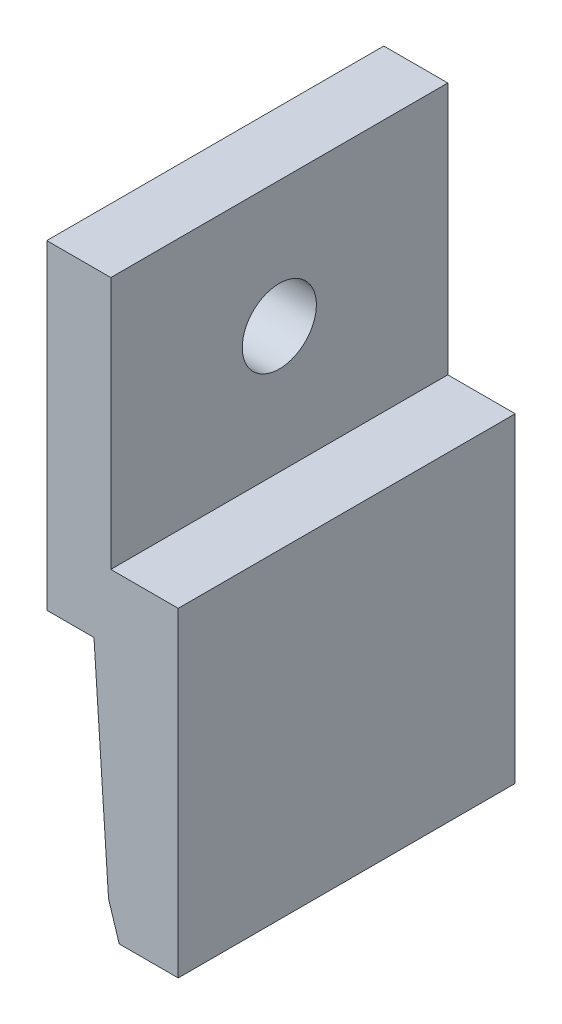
ISO-10303-21;
HEADER;
FILE_DESCRIPTION(('STEP AP214'),'2;1');
FILE_NAME('part.step','',(''),(''),'','','');
FILE_SCHEMA(('AUTOMOTIVE_DESIGN { 1 0 10303 214 1 1 1 1 }'));
ENDSEC;
DATA;
#1=APPLICATION_CONTEXT('core data for automotive mechanical design processes');
#2=APPLICATION_PROTOCOL_DEFINITION('international standard','automotive_design',2000,#1);
#3=PRODUCT_CONTEXT('',#1,'mechanical');
#4=PRODUCT('Part','Part','',(#3));
#5=PRODUCT_RELATED_PRODUCT_CATEGORY('part','',(#4));
#6=PRODUCT_DEFINITION_FORMATION('','',#4);
#7=PRODUCT_DEFINITION_CONTEXT('part definition',#1,'design');
#8=PRODUCT_DEFINITION('design','',#6,#7);
#9=PRODUCT_DEFINITION_SHAPE('','',#8);
#10=(LENGTH_UNIT() NAMED_UNIT(*) SI_UNIT(.MILLI.,.METRE.));
#11=(NAMED_UNIT(*) PLANE_ANGLE_UNIT() SI_UNIT($,.RADIAN.));
#12=(NAMED_UNIT(*) SI_UNIT($,.STERADIAN.) SOLID_ANGLE_UNIT());
#13=UNCERTAINTY_MEASURE_WITH_UNIT(LENGTH_MEASURE(1.E-05),#10,'distance_accuracy_value','');
#14=(GEOMETRIC_REPRESENTATION_CONTEXT(3) GLOBAL_UNCERTAINTY_ASSIGNED_CONTEXT((#13)) GLOBAL_UNIT_ASSIGNED_CONTEXT((#10,
#11,#12)) REPRESENTATION_CONTEXT('',''));
#15=CARTESIAN_POINT('',(0.,0.,0.));
#16=DIRECTION('',(0.,0.,1.));
#17=DIRECTION('',(1.,0.,0.));
#18=AXIS2_PLACEMENT_3D('',#15,#16,#17);
#19=CARTESIAN_POINT('',(6.,-19.,20.));
#20=DIRECTION('',(0.,1.,0.));
#21=DIRECTION('',(0.,0.,1.));
#22=AXIS2_PLACEMENT_3D('',#19,#20,#21);
#23=PLANE('',#22);
#24=DIRECTION('',(1.,0.,0.));
#25=VECTOR('',#24,1.);
#26=CARTESIAN_POINT('',(6.,-19.,20.));
#27=LINE('',#26,#25);
#28=CARTESIAN_POINT('',(2.5,-19.,20.));
#29=VERTEX_POINT('',#28);
#30=CARTESIAN_POINT('',(6.,-19.,20.));
#31=VERTEX_POINT('',#30);
#32=EDGE_CURVE('E114',#29,#31,#27,.T.);
#33=ORIENTED_EDGE('',*,*,#32,.F.);
#34=DIRECTION('',(0.,0.,1.));
#35=VECTOR('',#34,1.);
#36=CARTESIAN_POINT('',(2.5,-19.,-1.));
#37=LINE('',#36,#35);
#38=CARTESIAN_POINT('',(2.5,-19.,0.));
#39=VERTEX_POINT('',#38);
#40=EDGE_CURVE('E103',#39,#29,#37,.T.);
#41=ORIENTED_EDGE('',*,*,#40,.F.);
#42=DIRECTION('',(1.,0.,0.));
#43=VECTOR('',#42,1.);
#44=CARTESIAN_POINT('',(6.,-19.,0.));
#45=LINE('',#44,#43);
#46=CARTESIAN_POINT('',(6.,-19.,0.));
#47=VERTEX_POINT('',#46);
#48=EDGE_CURVE('E141',#39,#47,#45,.T.);
#49=ORIENTED_EDGE('',*,*,#48,.T.);
#50=DIRECTION('',(0.,0.,-1.));
#51=VECTOR('',#50,1.);
#52=CARTESIAN_POINT('',(6.,-19.,20.));
#53=LINE('',#52,#51);
#54=EDGE_CURVE('E120',#31,#47,#53,.T.);
#55=ORIENTED_EDGE('',*,*,#54,.F.);
#56=EDGE_LOOP('',(#33,#41,#49,#55));
#57=FACE_BOUND('',#56,.T.);
#58=ADVANCED_FACE('F35',(#57),#23,.F.);
#59=CARTESIAN_POINT('',(6.,0.,20.));
#60=DIRECTION('',(-1.,0.,0.));
#61=DIRECTION('',(0.,-1.,0.));
#62=AXIS2_PLACEMENT_3D('',#59,#60,#61);
#63=PLANE('',#62);
#64=DIRECTION('',(0.,1.,0.));
#65=VECTOR('',#64,1.);
#66=CARTESIAN_POINT('',(6.,0.,0.));
#67=LINE('',#66,#65);
#68=CARTESIAN_POINT('',(6.,0.,0.));
#69=VERTEX_POINT('',#68);
#70=EDGE_CURVE('E143',#47,#69,#67,.T.);
#71=ORIENTED_EDGE('',*,*,#70,.T.);
#72=DIRECTION('',(0.,0.,-1.));
#73=VECTOR('',#72,1.);
#74=CARTESIAN_POINT('',(6.,0.,20.));
#75=LINE('',#74,#73);
#76=CARTESIAN_POINT('',(6.,0.,20.));
#77=VERTEX_POINT('',#76);
#78=EDGE_CURVE('E153',#77,#69,#75,.T.);
#79=ORIENTED_EDGE('',*,*,#78,.F.);
#80=DIRECTION('',(0.,1.,0.));
#81=VECTOR('',#80,1.);
#82=CARTESIAN_POINT('',(6.,0.,20.));
#83=LINE('',#82,#81);
#84=EDGE_CURVE('E122',#31,#77,#83,.T.);
#85=ORIENTED_EDGE('',*,*,#84,.F.);
#86=ORIENTED_EDGE('',*,*,#54,.T.);
#87=EDGE_LOOP('',(#71,#79,#85,#86));
#88=FACE_BOUND('',#87,.T.);
#89=ADVANCED_FACE('F201',(#88),#63,.F.);
#90=CARTESIAN_POINT('',(2.,0.,20.));
#91=DIRECTION('',(0.,-1.,0.));
#92=DIRECTION('',(1.,0.,0.));
#93=AXIS2_PLACEMENT_3D('',#90,#91,#92);
#94=PLANE('',#93);
#95=DIRECTION('',(-1.,0.,0.));
#96=VECTOR('',#95,1.);
#97=CARTESIAN_POINT('',(2.,0.,0.));
#98=LINE('',#97,#96);
#99=CARTESIAN_POINT('',(2.,0.,0.));
#100=VERTEX_POINT('',#99);
#101=EDGE_CURVE('E145',#69,#100,#98,.T.);
#102=ORIENTED_EDGE('',*,*,#101,.T.);
#103=DIRECTION('',(0.,0.,-1.));
#104=VECTOR('',#103,1.);
#105=CARTESIAN_POINT('',(2.,0.,20.));
#106=LINE('',#105,#104);
#107=CARTESIAN_POINT('',(2.,0.,20.));
#108=VERTEX_POINT('',#107);
#109=EDGE_CURVE('E150',#108,#100,#106,.T.);
#110=ORIENTED_EDGE('',*,*,#109,.F.);
#111=DIRECTION('',(-1.,0.,0.));
#112=VECTOR('',#111,1.);
#113=CARTESIAN_POINT('',(2.,0.,20.));
#114=LINE('',#113,#112);
#115=EDGE_CURVE('E125',#77,#108,#114,.T.);
#116=ORIENTED_EDGE('',*,*,#115,.F.);
#117=ORIENTED_EDGE('',*,*,#78,.T.);
#118=EDGE_LOOP('',(#102,#110,#116,#117));
#119=FACE_BOUND('',#118,.T.);
#120=ADVANCED_FACE('F198',(#119),#94,.F.);
#121=CARTESIAN_POINT('',(2.,15.,20.));
#122=DIRECTION('',(-1.,0.,0.));
#123=DIRECTION('',(0.,-1.,0.));
#124=AXIS2_PLACEMENT_3D('',#121,#122,#123);
#125=PLANE('',#124);
#126=CARTESIAN_POINT('',(2.,7.5,10.));
#127=DIRECTION('',(1.,0.,0.));
#128=DIRECTION('',(0.,1.,0.));
#129=AXIS2_PLACEMENT_3D('',#126,#127,#128);
#130=CIRCLE('',#129,2.2);
#131=CARTESIAN_POINT('',(2.,9.7,10.));
#132=VERTEX_POINT('',#131);
#133=EDGE_CURVE('E235',#132,#132,#130,.T.);
#134=ORIENTED_EDGE('',*,*,#133,.F.);
#135=EDGE_LOOP('',(#134));
#136=FACE_BOUND('',#135,.T.);
#137=DIRECTION('',(0.,1.,0.));
#138=VECTOR('',#137,1.);
#139=CARTESIAN_POINT('',(2.,15.,0.));
#140=LINE('',#139,#138);
#141=CARTESIAN_POINT('',(2.,15.,0.));
#142=VERTEX_POINT('',#141);
#143=EDGE_CURVE('E128',#100,#142,#140,.T.);
#144=ORIENTED_EDGE('',*,*,#143,.T.);
#145=DIRECTION('',(0.,0.,-1.));
#146=VECTOR('',#145,1.);
#147=CARTESIAN_POINT('',(2.,15.,20.));
#148=LINE('',#147,#146);
#149=CARTESIAN_POINT('',(2.,15.,20.));
#150=VERTEX_POINT('',#149);
#151=EDGE_CURVE('E140',#150,#142,#148,.T.);
#152=ORIENTED_EDGE('',*,*,#151,.F.);
#153=DIRECTION('',(0.,1.,0.));
#154=VECTOR('',#153,1.);
#155=CARTESIAN_POINT('',(2.,15.,20.));
#156=LINE('',#155,#154);
#157=EDGE_CURVE('E135',#108,#150,#156,.T.);
#158=ORIENTED_EDGE('',*,*,#157,.F.);
#159=ORIENTED_EDGE('',*,*,#109,.T.);
#160=EDGE_LOOP('',(#144,#152,#158,#159));
#161=FACE_BOUND('',#160,.T.);
#162=ADVANCED_FACE('F193',(#136,#161),#125,.F.);
#163=CARTESIAN_POINT('',(-2.,15.,20.));
#164=DIRECTION('',(0.,-1.,0.));
#165=DIRECTION('',(0.,0.,-1.));
#166=AXIS2_PLACEMENT_3D('',#163,#164,#165);
#167=PLANE('',#166);
#168=DIRECTION('',(-1.,0.,0.));
#169=VECTOR('',#168,1.);
#170=CARTESIAN_POINT('',(-2.,15.,0.));
#171=LINE('',#170,#169);
#172=CARTESIAN_POINT('',(-1.8,15.,0.));
#173=VERTEX_POINT('',#172);
#174=EDGE_CURVE('E123',#142,#173,#171,.T.);
#175=ORIENTED_EDGE('',*,*,#174,.T.);
#176=DIRECTION('',(0.,0.,-1.));
#177=VECTOR('',#176,1.);
#178=CARTESIAN_POINT('',(-1.8,15.,0.));
#179=LINE('',#178,#177);
#180=CARTESIAN_POINT('',(-1.8,15.,20.));
#181=VERTEX_POINT('',#180);
#182=EDGE_CURVE('E176',#181,#173,#179,.T.);
#183=ORIENTED_EDGE('',*,*,#182,.F.);
#184=DIRECTION('',(-1.,0.,0.));
#185=VECTOR('',#184,1.);
#186=CARTESIAN_POINT('',(-2.,15.,20.));
#187=LINE('',#186,#185);
#188=EDGE_CURVE('E137',#150,#181,#187,.T.);
#189=ORIENTED_EDGE('',*,*,#188,.F.);
#190=ORIENTED_EDGE('',*,*,#151,.T.);
#191=EDGE_LOOP('',(#175,#183,#189,#190));
#192=FACE_BOUND('',#191,.T.);
#193=ADVANCED_FACE('F187',(#192),#167,.F.);
#194=CARTESIAN_POINT('',(0.,0.,20.));
#195=DIRECTION('',(0.,0.,-1.));
#196=DIRECTION('',(-1.,0.,0.));
#197=AXIS2_PLACEMENT_3D('',#194,#195,#196);
#198=PLANE('',#197);
#199=DIRECTION('',(-0.0665190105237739,0.997785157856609,0.));
#200=VECTOR('',#199,1.);
#201=CARTESIAN_POINT('',(1.,-4.,20.));
#202=LINE('',#201,#200);
#203=CARTESIAN_POINT('',(1.86666666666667,-17.,20.));
#204=VERTEX_POINT('',#203);
#205=CARTESIAN_POINT('',(1.,-4.,20.));
#206=VERTEX_POINT('',#205);
#207=EDGE_CURVE('E117',#204,#206,#202,.T.);
#208=ORIENTED_EDGE('',*,*,#207,.F.);
#209=DIRECTION('',(-0.301891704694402,0.953342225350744,0.));
#210=VECTOR('',#209,1.);
#211=CARTESIAN_POINT('',(1.86666666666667,-17.,20.));
#212=LINE('',#211,#210);
#213=EDGE_CURVE('E50',#29,#204,#212,.T.);
#214=ORIENTED_EDGE('',*,*,#213,.F.);
#215=ORIENTED_EDGE('',*,*,#32,.T.);
#216=ORIENTED_EDGE('',*,*,#84,.T.);
#217=ORIENTED_EDGE('',*,*,#115,.T.);
#218=ORIENTED_EDGE('',*,*,#157,.T.);
#219=ORIENTED_EDGE('',*,*,#188,.T.);
#220=DIRECTION('',(0.,1.,0.));
#221=VECTOR('',#220,1.);
#222=CARTESIAN_POINT('',(-1.8,15.,20.));
#223=LINE('',#222,#221);
#224=CARTESIAN_POINT('',(-1.8,-4.,20.));
#225=VERTEX_POINT('',#224);
#226=EDGE_CURVE('E174',#225,#181,#223,.T.);
#227=ORIENTED_EDGE('',*,*,#226,.F.);
#228=DIRECTION('',(-1.,0.,0.));
#229=VECTOR('',#228,1.);
#230=CARTESIAN_POINT('',(-2.,-4.,20.));
#231=LINE('',#230,#229);
#232=EDGE_CURVE('E178',#206,#225,#231,.T.);
#233=ORIENTED_EDGE('',*,*,#232,.F.);
#234=EDGE_LOOP('',(#208,#214,#215,#216,#217,#218,#219,#227,#233));
#235=FACE_BOUND('',#234,.T.);
#236=ADVANCED_FACE('F113',(#235),#198,.F.);
#237=CARTESIAN_POINT('',(0.,0.,0.));
#238=DIRECTION('',(0.,0.,-1.));
#239=DIRECTION('',(-1.,0.,0.));
#240=AXIS2_PLACEMENT_3D('',#237,#238,#239);
#241=PLANE('',#240);
#242=DIRECTION('',(0.301891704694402,-0.953342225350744,0.));
#243=VECTOR('',#242,1.);
#244=CARTESIAN_POINT('',(-3.19616258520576,-1.01211815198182,0.));
#245=LINE('',#244,#243);
#246=CARTESIAN_POINT('',(1.86666666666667,-17.,0.));
#247=VERTEX_POINT('',#246);
#248=EDGE_CURVE('E106',#247,#39,#245,.T.);
#249=ORIENTED_EDGE('',*,*,#248,.F.);
#250=DIRECTION('',(0.0665190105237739,-0.997785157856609,0.));
#251=VECTOR('',#250,1.);
#252=CARTESIAN_POINT('',(0.730088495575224,0.0486725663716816,0.));
#253=LINE('',#252,#251);
#254=CARTESIAN_POINT('',(1.,-4.,0.));
#255=VERTEX_POINT('',#254);
#256=EDGE_CURVE('E43',#255,#247,#253,.T.);
#257=ORIENTED_EDGE('',*,*,#256,.F.);
#258=DIRECTION('',(1.,0.,0.));
#259=VECTOR('',#258,1.);
#260=CARTESIAN_POINT('',(0.,-4.,0.));
#261=LINE('',#260,#259);
#262=CARTESIAN_POINT('',(-1.8,-4.,0.));
#263=VERTEX_POINT('',#262);
#264=EDGE_CURVE('E157',#263,#255,#261,.T.);
#265=ORIENTED_EDGE('',*,*,#264,.F.);
#266=DIRECTION('',(0.,-1.,0.));
#267=VECTOR('',#266,1.);
#268=CARTESIAN_POINT('',(-1.8,-4.,0.));
#269=LINE('',#268,#267);
#270=EDGE_CURVE('E57',#173,#263,#269,.T.);
#271=ORIENTED_EDGE('',*,*,#270,.F.);
#272=ORIENTED_EDGE('',*,*,#174,.F.);
#273=ORIENTED_EDGE('',*,*,#143,.F.);
#274=ORIENTED_EDGE('',*,*,#101,.F.);
#275=ORIENTED_EDGE('',*,*,#70,.F.);
#276=ORIENTED_EDGE('',*,*,#48,.F.);
#277=EDGE_LOOP('',(#249,#257,#265,#271,#272,#273,#274,#275,#276));
#278=FACE_BOUND('',#277,.T.);
#279=ADVANCED_FACE('F167',(#278),#241,.T.);
#280=CARTESIAN_POINT('',(1.,-4.,-2.00000000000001));
#281=DIRECTION('',(0.997785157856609,0.0665190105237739,0.));
#282=DIRECTION('',(-0.0665190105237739,0.997785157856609,0.));
#283=AXIS2_PLACEMENT_3D('',#280,#281,#282);
#284=PLANE('',#283);
#285=ORIENTED_EDGE('',*,*,#256,.T.);
#286=DIRECTION('',(0.,0.,1.));
#287=VECTOR('',#286,1.);
#288=CARTESIAN_POINT('',(1.86666666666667,-17.,-2.00000000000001));
#289=LINE('',#288,#287);
#290=EDGE_CURVE('E11',#247,#204,#289,.T.);
#291=ORIENTED_EDGE('',*,*,#290,.T.);
#292=ORIENTED_EDGE('',*,*,#207,.T.);
#293=DIRECTION('',(0.,0.,1.));
#294=VECTOR('',#293,1.);
#295=CARTESIAN_POINT('',(1.,-4.,-2.00000000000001));
#296=LINE('',#295,#294);
#297=EDGE_CURVE('E131',#255,#206,#296,.T.);
#298=ORIENTED_EDGE('',*,*,#297,.F.);
#299=EDGE_LOOP('',(#285,#291,#292,#298));
#300=FACE_BOUND('',#299,.T.);
#301=ADVANCED_FACE('F163',(#300),#284,.F.);
#302=CARTESIAN_POINT('',(-2.,-4.,-2.00000000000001));
#303=DIRECTION('',(0.,1.,0.));
#304=DIRECTION('',(-1.,0.,0.));
#305=AXIS2_PLACEMENT_3D('',#302,#303,#304);
#306=PLANE('',#305);
#307=ORIENTED_EDGE('',*,*,#232,.T.);
#308=DIRECTION('',(0.,0.,1.));
#309=VECTOR('',#308,1.);
#310=CARTESIAN_POINT('',(-1.8,-4.,20.));
#311=LINE('',#310,#309);
#312=EDGE_CURVE('E170',#263,#225,#311,.T.);
#313=ORIENTED_EDGE('',*,*,#312,.F.);
#314=ORIENTED_EDGE('',*,*,#264,.T.);
#315=ORIENTED_EDGE('',*,*,#297,.T.);
#316=EDGE_LOOP('',(#307,#313,#314,#315));
#317=FACE_BOUND('',#316,.T.);
#318=ADVANCED_FACE('F181',(#317),#306,.F.);
#319=CARTESIAN_POINT('',(-1.8,0.,0.));
#320=DIRECTION('',(1.,0.,0.));
#321=DIRECTION('',(0.,0.,-1.));
#322=AXIS2_PLACEMENT_3D('',#319,#320,#321);
#323=PLANE('',#322);
#324=CARTESIAN_POINT('',(-1.8,7.5,10.));
#325=DIRECTION('',(1.,0.,0.));
#326=DIRECTION('',(0.,0.,-1.));
#327=AXIS2_PLACEMENT_3D('',#324,#325,#326);
#328=CIRCLE('',#327,2.2);
#329=CARTESIAN_POINT('',(-1.8,7.5,7.8));
#330=VERTEX_POINT('',#329);
#331=EDGE_CURVE('E38',#330,#330,#328,.T.);
#332=ORIENTED_EDGE('',*,*,#331,.T.);
#333=EDGE_LOOP('',(#332));
#334=FACE_BOUND('',#333,.T.);
#335=ORIENTED_EDGE('',*,*,#270,.T.);
#336=ORIENTED_EDGE('',*,*,#312,.T.);
#337=ORIENTED_EDGE('',*,*,#226,.T.);
#338=ORIENTED_EDGE('',*,*,#182,.T.);
#339=EDGE_LOOP('',(#335,#336,#337,#338));
#340=FACE_BOUND('',#339,.T.);
#341=ADVANCED_FACE('F185',(#334,#340),#323,.F.);
#342=CARTESIAN_POINT('',(1.86666666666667,-17.,-1.));
#343=DIRECTION('',(0.953342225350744,0.301891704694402,0.));
#344=DIRECTION('',(-0.301891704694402,0.953342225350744,0.));
#345=AXIS2_PLACEMENT_3D('',#342,#343,#344);
#346=PLANE('',#345);
#347=ORIENTED_EDGE('',*,*,#248,.T.);
#348=ORIENTED_EDGE('',*,*,#40,.T.);
#349=ORIENTED_EDGE('',*,*,#213,.T.);
#350=ORIENTED_EDGE('',*,*,#290,.F.);
#351=EDGE_LOOP('',(#347,#348,#349,#350));
#352=FACE_BOUND('',#351,.T.);
#353=ADVANCED_FACE('F104',(#352),#346,.F.);
#354=CARTESIAN_POINT('',(-2.99999999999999,7.5,10.));
#355=DIRECTION('',(1.,0.,0.));
#356=DIRECTION('',(0.,1.,0.));
#357=AXIS2_PLACEMENT_3D('',#354,#355,#356);
#358=CYLINDRICAL_SURFACE('',#357,2.2);
#359=ORIENTED_EDGE('',*,*,#133,.T.);
#360=EDGE_LOOP('',(#359));
#361=FACE_BOUND('',#360,.T.);
#362=ORIENTED_EDGE('',*,*,#331,.F.);
#363=EDGE_LOOP('',(#362));
#364=FACE_BOUND('',#363,.T.);
#365=ADVANCED_FACE('F227',(#361,#364),#358,.F.);
#366=CLOSED_SHELL('',(#58,#89,#120,#162,#193,#236,#279,#301,#318,#341,#353,#365));
#367=MANIFOLD_SOLID_BREP('B2',#366);
#368=ADVANCED_BREP_SHAPE_REPRESENTATION('',(#18,#367),#14);
#369=SHAPE_DEFINITION_REPRESENTATION(#9,#368);
ENDSEC;
END-ISO-10303-21;
